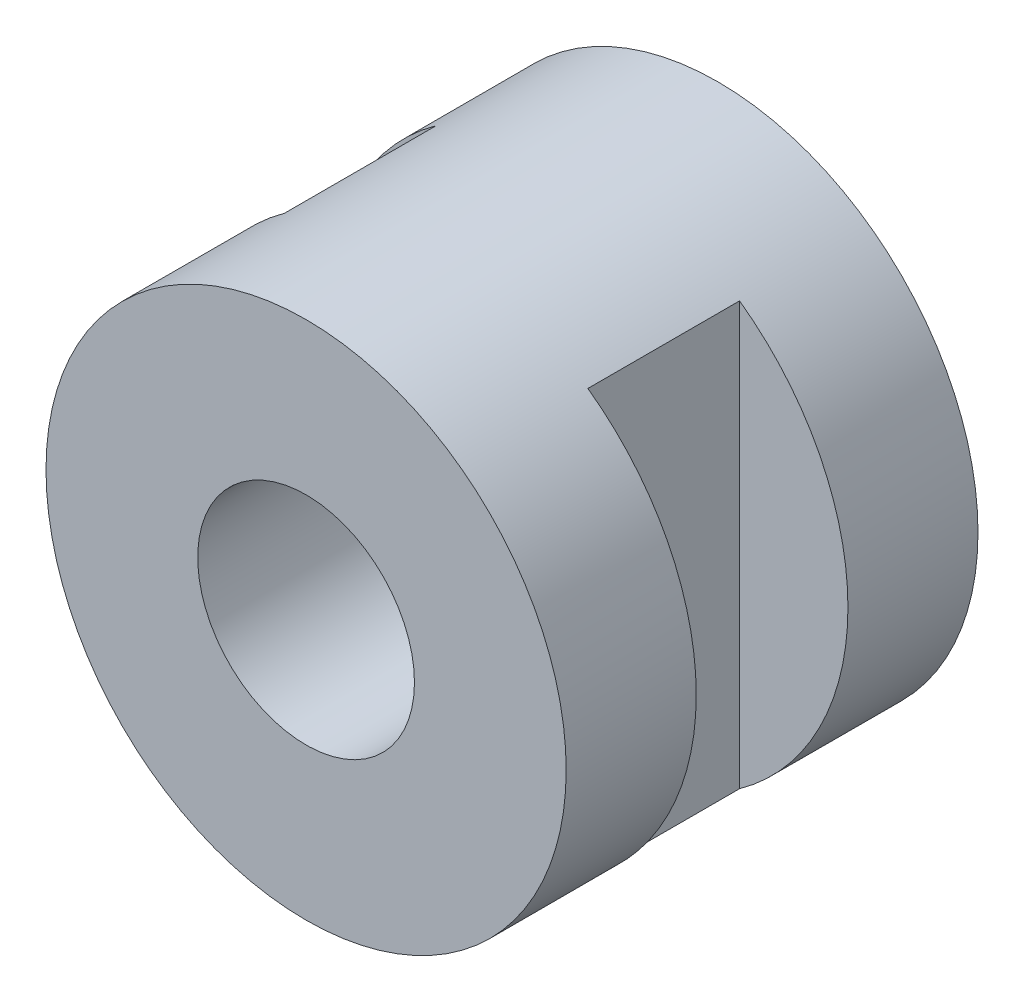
ISO-10303-21;
HEADER;
FILE_DESCRIPTION(('STEP AP214'),'2;1');
FILE_NAME('part.step','',(''),(''),'','','');
FILE_SCHEMA(('AUTOMOTIVE_DESIGN { 1 0 10303 214 1 1 1 1 }'));
ENDSEC;
DATA;
#1=APPLICATION_CONTEXT('core data for automotive mechanical design processes');
#2=APPLICATION_PROTOCOL_DEFINITION('international standard','automotive_design',2000,#1);
#3=PRODUCT_CONTEXT('',#1,'mechanical');
#4=PRODUCT('Part','Part','',(#3));
#5=PRODUCT_RELATED_PRODUCT_CATEGORY('part','',(#4));
#6=PRODUCT_DEFINITION_FORMATION('','',#4);
#7=PRODUCT_DEFINITION_CONTEXT('part definition',#1,'design');
#8=PRODUCT_DEFINITION('design','',#6,#7);
#9=PRODUCT_DEFINITION_SHAPE('','',#8);
#10=(LENGTH_UNIT() NAMED_UNIT(*) SI_UNIT(.MILLI.,.METRE.));
#11=(NAMED_UNIT(*) PLANE_ANGLE_UNIT() SI_UNIT($,.RADIAN.));
#12=(NAMED_UNIT(*) SI_UNIT($,.STERADIAN.) SOLID_ANGLE_UNIT());
#13=UNCERTAINTY_MEASURE_WITH_UNIT(LENGTH_MEASURE(1.E-05),#10,'distance_accuracy_value','');
#14=(GEOMETRIC_REPRESENTATION_CONTEXT(3) GLOBAL_UNCERTAINTY_ASSIGNED_CONTEXT((#13)) GLOBAL_UNIT_ASSIGNED_CONTEXT((#10,
#11,#12)) REPRESENTATION_CONTEXT('',''));
#15=CARTESIAN_POINT('',(0.,0.,0.));
#16=DIRECTION('',(0.,0.,1.));
#17=DIRECTION('',(1.,0.,0.));
#18=AXIS2_PLACEMENT_3D('',#15,#16,#17);
#19=CARTESIAN_POINT('',(0.,0.,9.5));
#20=DIRECTION('',(0.,0.,-1.));
#21=DIRECTION('',(-1.,0.,0.));
#22=AXIS2_PLACEMENT_3D('',#19,#20,#21);
#23=CYLINDRICAL_SURFACE('',#22,6.);
#24=CARTESIAN_POINT('',(0.,0.,6.5));
#25=DIRECTION('',(0.,0.,1.));
#26=DIRECTION('',(1.,0.,0.));
#27=AXIS2_PLACEMENT_3D('',#24,#25,#26);
#28=CIRCLE('',#27,6.);
#29=CARTESIAN_POINT('',(-3.5,4.87339717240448,6.5));
#30=VERTEX_POINT('',#29);
#31=CARTESIAN_POINT('',(-3.5,-4.87339717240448,6.5));
#32=VERTEX_POINT('',#31);
#33=EDGE_CURVE('E39',#30,#32,#28,.T.);
#34=ORIENTED_EDGE('',*,*,#33,.T.);
#35=DIRECTION('',(0.,0.,-1.));
#36=VECTOR('',#35,1.);
#37=CARTESIAN_POINT('',(-3.5,-4.87339717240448,9.5));
#38=LINE('',#37,#36);
#39=CARTESIAN_POINT('',(-3.5,-4.87339717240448,3.));
#40=VERTEX_POINT('',#39);
#41=EDGE_CURVE('E11',#32,#40,#38,.T.);
#42=ORIENTED_EDGE('',*,*,#41,.T.);
#43=CARTESIAN_POINT('',(0.,0.,3.));
#44=DIRECTION('',(0.,0.,-1.));
#45=DIRECTION('',(-1.,0.,0.));
#46=AXIS2_PLACEMENT_3D('',#43,#44,#45);
#47=CIRCLE('',#46,6.);
#48=CARTESIAN_POINT('',(-3.5,4.87339717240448,3.));
#49=VERTEX_POINT('',#48);
#50=EDGE_CURVE('E72',#40,#49,#47,.T.);
#51=ORIENTED_EDGE('',*,*,#50,.T.);
#52=DIRECTION('',(0.,0.,-1.));
#53=VECTOR('',#52,1.);
#54=CARTESIAN_POINT('',(-3.5,4.87339717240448,9.5));
#55=LINE('',#54,#53);
#56=EDGE_CURVE('E78',#49,#30,#55,.F.);
#57=ORIENTED_EDGE('',*,*,#56,.T.);
#58=EDGE_LOOP('',(#34,#42,#51,#57));
#59=FACE_BOUND('',#58,.T.);
#60=DIRECTION('',(0.,0.,-1.));
#61=VECTOR('',#60,1.);
#62=CARTESIAN_POINT('',(3.5,-4.87339717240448,9.5));
#63=LINE('',#62,#61);
#64=CARTESIAN_POINT('',(3.5,-4.87339717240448,3.));
#65=VERTEX_POINT('',#64);
#66=CARTESIAN_POINT('',(3.5,-4.87339717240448,6.5));
#67=VERTEX_POINT('',#66);
#68=EDGE_CURVE('E93',#65,#67,#63,.F.);
#69=ORIENTED_EDGE('',*,*,#68,.T.);
#70=CARTESIAN_POINT('',(0.,0.,6.5));
#71=DIRECTION('',(0.,0.,1.));
#72=DIRECTION('',(1.,0.,0.));
#73=AXIS2_PLACEMENT_3D('',#70,#71,#72);
#74=CIRCLE('',#73,6.);
#75=CARTESIAN_POINT('',(3.5,4.87339717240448,6.5));
#76=VERTEX_POINT('',#75);
#77=EDGE_CURVE('E87',#67,#76,#74,.T.);
#78=ORIENTED_EDGE('',*,*,#77,.T.);
#79=DIRECTION('',(0.,0.,-1.));
#80=VECTOR('',#79,1.);
#81=CARTESIAN_POINT('',(3.5,4.87339717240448,9.5));
#82=LINE('',#81,#80);
#83=CARTESIAN_POINT('',(3.5,4.87339717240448,3.));
#84=VERTEX_POINT('',#83);
#85=EDGE_CURVE('E90',#76,#84,#82,.T.);
#86=ORIENTED_EDGE('',*,*,#85,.T.);
#87=CARTESIAN_POINT('',(0.,0.,3.));
#88=DIRECTION('',(0.,0.,-1.));
#89=DIRECTION('',(-1.,0.,0.));
#90=AXIS2_PLACEMENT_3D('',#87,#88,#89);
#91=CIRCLE('',#90,6.);
#92=EDGE_CURVE('E96',#84,#65,#91,.T.);
#93=ORIENTED_EDGE('',*,*,#92,.T.);
#94=EDGE_LOOP('',(#69,#78,#86,#93));
#95=FACE_BOUND('',#94,.T.);
#96=CARTESIAN_POINT('',(0.,0.,9.5));
#97=DIRECTION('',(0.,0.,1.));
#98=DIRECTION('',(1.,0.,0.));
#99=AXIS2_PLACEMENT_3D('',#96,#97,#98);
#100=CIRCLE('',#99,6.);
#101=CARTESIAN_POINT('',(6.,0.,9.5));
#102=VERTEX_POINT('',#101);
#103=EDGE_CURVE('E99',#102,#102,#100,.T.);
#104=ORIENTED_EDGE('',*,*,#103,.F.);
#105=EDGE_LOOP('',(#104));
#106=FACE_BOUND('',#105,.T.);
#107=CARTESIAN_POINT('',(0.,0.,0.));
#108=DIRECTION('',(0.,0.,1.));
#109=DIRECTION('',(1.,0.,0.));
#110=AXIS2_PLACEMENT_3D('',#107,#108,#109);
#111=CIRCLE('',#110,6.);
#112=CARTESIAN_POINT('',(6.,0.,0.));
#113=VERTEX_POINT('',#112);
#114=EDGE_CURVE('E100',#113,#113,#111,.T.);
#115=ORIENTED_EDGE('',*,*,#114,.T.);
#116=EDGE_LOOP('',(#115));
#117=FACE_BOUND('',#116,.T.);
#118=ADVANCED_FACE('F32',(#59,#95,#106,#117),#23,.T.);
#119=CARTESIAN_POINT('',(0.,0.,9.5));
#120=DIRECTION('',(0.,0.,1.));
#121=DIRECTION('',(1.,0.,0.));
#122=AXIS2_PLACEMENT_3D('',#119,#120,#121);
#123=PLANE('',#122);
#124=CARTESIAN_POINT('',(0.,0.,9.5));
#125=DIRECTION('',(0.,0.,1.));
#126=DIRECTION('',(1.,0.,0.));
#127=AXIS2_PLACEMENT_3D('',#124,#125,#126);
#128=CIRCLE('',#127,2.5);
#129=CARTESIAN_POINT('',(2.5,0.,9.5));
#130=VERTEX_POINT('',#129);
#131=EDGE_CURVE('E106',#130,#130,#128,.T.);
#132=ORIENTED_EDGE('',*,*,#131,.F.);
#133=EDGE_LOOP('',(#132));
#134=FACE_BOUND('',#133,.T.);
#135=ORIENTED_EDGE('',*,*,#103,.T.);
#136=EDGE_LOOP('',(#135));
#137=FACE_BOUND('',#136,.T.);
#138=ADVANCED_FACE('F133',(#134,#137),#123,.T.);
#139=CARTESIAN_POINT('',(0.,0.,0.));
#140=DIRECTION('',(0.,0.,1.));
#141=DIRECTION('',(1.,0.,0.));
#142=AXIS2_PLACEMENT_3D('',#139,#140,#141);
#143=PLANE('',#142);
#144=CARTESIAN_POINT('',(0.,0.,0.));
#145=DIRECTION('',(0.,0.,1.));
#146=DIRECTION('',(1.,0.,0.));
#147=AXIS2_PLACEMENT_3D('',#144,#145,#146);
#148=CIRCLE('',#147,2.5);
#149=CARTESIAN_POINT('',(2.5,0.,0.));
#150=VERTEX_POINT('',#149);
#151=EDGE_CURVE('E103',#150,#150,#148,.T.);
#152=ORIENTED_EDGE('',*,*,#151,.T.);
#153=EDGE_LOOP('',(#152));
#154=FACE_BOUND('',#153,.T.);
#155=ORIENTED_EDGE('',*,*,#114,.F.);
#156=EDGE_LOOP('',(#155));
#157=FACE_BOUND('',#156,.T.);
#158=ADVANCED_FACE('F137',(#154,#157),#143,.F.);
#159=CARTESIAN_POINT('',(0.,0.,0.));
#160=DIRECTION('',(0.,0.,1.));
#161=DIRECTION('',(1.,0.,0.));
#162=AXIS2_PLACEMENT_3D('',#159,#160,#161);
#163=CYLINDRICAL_SURFACE('',#162,2.5);
#164=ORIENTED_EDGE('',*,*,#151,.F.);
#165=EDGE_LOOP('',(#164));
#166=FACE_BOUND('',#165,.T.);
#167=ORIENTED_EDGE('',*,*,#131,.T.);
#168=EDGE_LOOP('',(#167));
#169=FACE_BOUND('',#168,.T.);
#170=ADVANCED_FACE('F130',(#166,#169),#163,.F.);
#171=CARTESIAN_POINT('',(6.22055551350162,-6.,6.5));
#172=DIRECTION('',(0.,0.,1.));
#173=DIRECTION('',(1.,0.,0.));
#174=AXIS2_PLACEMENT_3D('',#171,#172,#173);
#175=PLANE('',#174);
#176=DIRECTION('',(0.,1.,0.));
#177=VECTOR('',#176,1.);
#178=CARTESIAN_POINT('',(3.5,-6.,6.5));
#179=LINE('',#178,#177);
#180=EDGE_CURVE('E109',#67,#76,#179,.T.);
#181=ORIENTED_EDGE('',*,*,#180,.T.);
#182=ORIENTED_EDGE('',*,*,#77,.F.);
#183=EDGE_LOOP('',(#181,#182));
#184=FACE_BOUND('',#183,.T.);
#185=ADVANCED_FACE('F117',(#184),#175,.F.);
#186=CARTESIAN_POINT('',(3.5,-6.,6.5));
#187=DIRECTION('',(-1.,0.,0.));
#188=DIRECTION('',(0.,0.,1.));
#189=AXIS2_PLACEMENT_3D('',#186,#187,#188);
#190=PLANE('',#189);
#191=ORIENTED_EDGE('',*,*,#180,.F.);
#192=ORIENTED_EDGE('',*,*,#68,.F.);
#193=DIRECTION('',(0.,1.,0.));
#194=VECTOR('',#193,1.);
#195=CARTESIAN_POINT('',(3.5,-6.,3.));
#196=LINE('',#195,#194);
#197=EDGE_CURVE('E53',#65,#84,#196,.T.);
#198=ORIENTED_EDGE('',*,*,#197,.T.);
#199=ORIENTED_EDGE('',*,*,#85,.F.);
#200=EDGE_LOOP('',(#191,#192,#198,#199));
#201=FACE_BOUND('',#200,.T.);
#202=ADVANCED_FACE('F120',(#201),#190,.F.);
#203=CARTESIAN_POINT('',(6.22055551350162,-6.,3.));
#204=DIRECTION('',(0.,0.,-1.));
#205=DIRECTION('',(-1.,0.,0.));
#206=AXIS2_PLACEMENT_3D('',#203,#204,#205);
#207=PLANE('',#206);
#208=ORIENTED_EDGE('',*,*,#197,.F.);
#209=ORIENTED_EDGE('',*,*,#92,.F.);
#210=EDGE_LOOP('',(#208,#209));
#211=FACE_BOUND('',#210,.T.);
#212=ADVANCED_FACE('F122',(#211),#207,.F.);
#213=CARTESIAN_POINT('',(-6.22055551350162,-6.,6.5));
#214=DIRECTION('',(0.,0.,1.));
#215=DIRECTION('',(1.,0.,0.));
#216=AXIS2_PLACEMENT_3D('',#213,#214,#215);
#217=PLANE('',#216);
#218=DIRECTION('',(0.,1.,0.));
#219=VECTOR('',#218,1.);
#220=CARTESIAN_POINT('',(-3.5,-6.,6.5));
#221=LINE('',#220,#219);
#222=EDGE_CURVE('E46',#32,#30,#221,.T.);
#223=ORIENTED_EDGE('',*,*,#222,.F.);
#224=ORIENTED_EDGE('',*,*,#33,.F.);
#225=EDGE_LOOP('',(#223,#224));
#226=FACE_BOUND('',#225,.T.);
#227=ADVANCED_FACE('F128',(#226),#217,.F.);
#228=CARTESIAN_POINT('',(-6.22055551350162,-6.,3.));
#229=DIRECTION('',(0.,0.,-1.));
#230=DIRECTION('',(-1.,0.,0.));
#231=AXIS2_PLACEMENT_3D('',#228,#229,#230);
#232=PLANE('',#231);
#233=DIRECTION('',(0.,1.,0.));
#234=VECTOR('',#233,1.);
#235=CARTESIAN_POINT('',(-3.5,-6.,3.));
#236=LINE('',#235,#234);
#237=EDGE_CURVE('E75',#40,#49,#236,.T.);
#238=ORIENTED_EDGE('',*,*,#237,.T.);
#239=ORIENTED_EDGE('',*,*,#50,.F.);
#240=EDGE_LOOP('',(#238,#239));
#241=FACE_BOUND('',#240,.T.);
#242=ADVANCED_FACE('F74',(#241),#232,.F.);
#243=CARTESIAN_POINT('',(-3.5,-6.,6.5));
#244=DIRECTION('',(1.,0.,0.));
#245=DIRECTION('',(0.,0.,-1.));
#246=AXIS2_PLACEMENT_3D('',#243,#244,#245);
#247=PLANE('',#246);
#248=ORIENTED_EDGE('',*,*,#222,.T.);
#249=ORIENTED_EDGE('',*,*,#56,.F.);
#250=ORIENTED_EDGE('',*,*,#237,.F.);
#251=ORIENTED_EDGE('',*,*,#41,.F.);
#252=EDGE_LOOP('',(#248,#249,#250,#251));
#253=FACE_BOUND('',#252,.T.);
#254=ADVANCED_FACE('F80',(#253),#247,.F.);
#255=CLOSED_SHELL('',(#118,#138,#158,#170,#185,#202,#212,#227,#242,#254));
#256=MANIFOLD_SOLID_BREP('B2',#255);
#257=ADVANCED_BREP_SHAPE_REPRESENTATION('',(#18,#256),#14);
#258=SHAPE_DEFINITION_REPRESENTATION(#9,#257);
ENDSEC;
END-ISO-10303-21;
